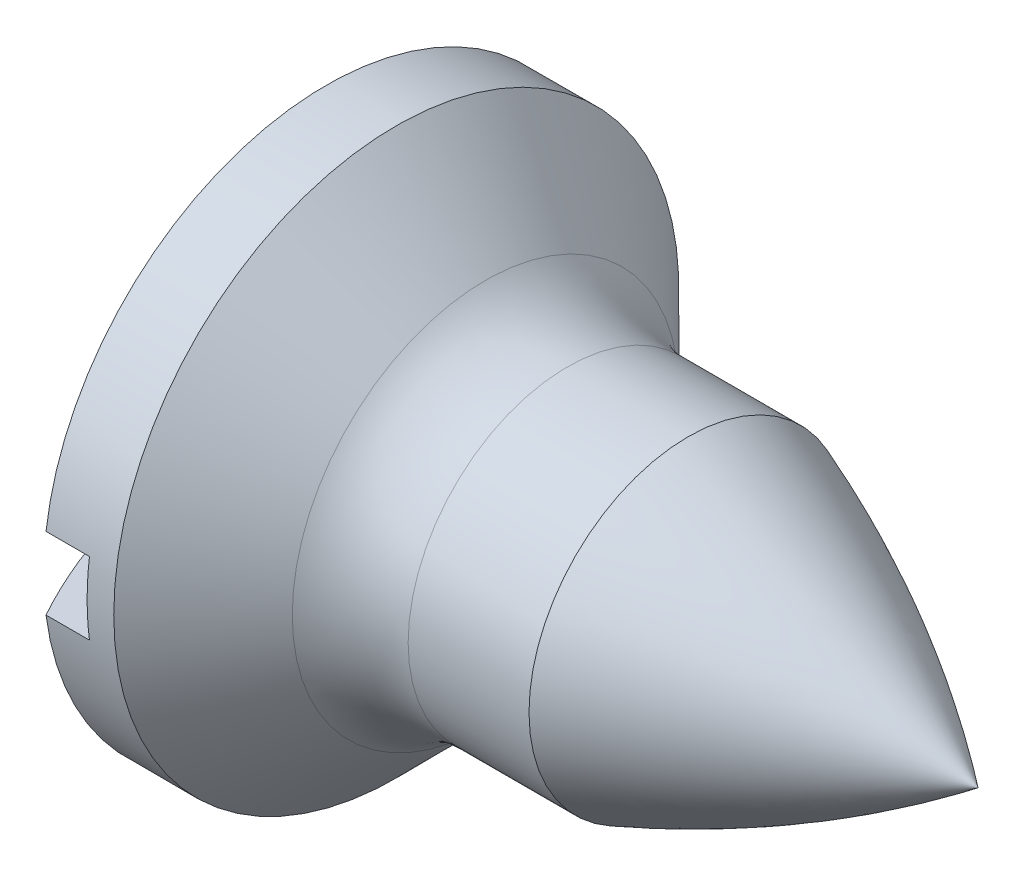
from build123d import *

# Parameters (mm, degrees)
SLOT_DEPTH      = 6.717309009
SLOT_DEPTH_BACK = 6.717309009


with BuildPart() as part:
    # Sketch1 → Base (revolve)
    with BuildSketch(Plane.XY, mode=Mode.PRIVATE) as base_sk:
        with BuildLine():
            Line((5.007820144, 1.1), (5.007820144, 0))
            Line((5.007820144, 0), (0, 0))
            ThreePointArc((0, 0), (0.129036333, 1.007789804), (0.507820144, 1.950558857))
            Line((0.507820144, 1.950558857), (0.991575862, 1.950558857))
            Line((0.991575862, 1.950558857), (1.607820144, 1.334314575))
            ThreePointArc((1.607820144, 1.334314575), (1.867358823, 1.160896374), (2.173505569, 1.1))
            Line((2.173505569, 1.1), (5.007820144, 1.1))
        make_face()
    revolve(base_sk.sketch.rotate(Axis((-40.194470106, 0, 0), (1, 0, 0)), 90), axis=Axis((-40.194470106, 0, 0), (1, 0, 0)))

    # Sketch2 → Slot (cut, two sides: drawn at the far end of the back side and taken through both)
    with BuildSketch(Plane.XY.offset(-SLOT_DEPTH_BACK)):
        with BuildLine():
            Line((0.007820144, 0.25), (0.807820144, 0.25))
            Line((0.807820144, 0.25), (0.807820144, -0.25))
            Line((0.807820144, -0.25), (0.007820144, -0.25))
            ThreePointArc((0.007820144, -0.25), (-0.05119685, 0), (0.007820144, 0.25))
        make_face()
    extrude(amount=SLOT_DEPTH + SLOT_DEPTH_BACK, mode=Mode.SUBTRACT)

    # Sketch4 → Cut-Revolve6 (revolve, cut)
    with BuildSketch(Plane.XY, mode=Mode.PRIVATE) as cut_revolve6_sk:
        with BuildLine():
            Line((5.007820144, 0), (5.507820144, 0))
            Line((5.507820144, 0), (5.507820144, -1.1))
            Line((5.507820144, -1.1), (5.007820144, -1.1))
            Line((5.007820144, -1.1), (3.007820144, -1.1))
            ThreePointArc((3.007820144, -1.1), (4.047253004, -0.621696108), (5.007820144, 0))
        make_face()
    revolve(cut_revolve6_sk.sketch.rotate(Axis((35.861031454, 0, 0), (-1, 0, 0)), 90), axis=Axis((35.861031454, 0, 0), (-1, 0, 0)), mode=Mode.SUBTRACT)


solid = part.part
